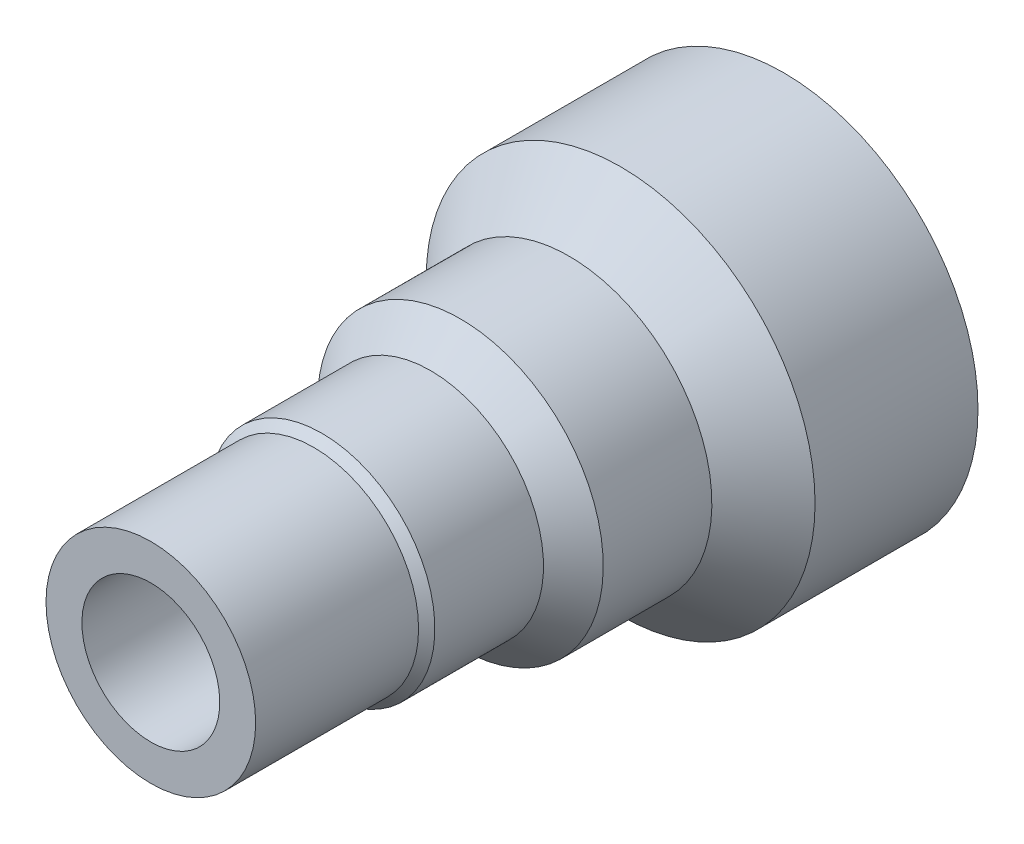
from build123d import *


with BuildPart() as part:
    # Sketch2 → Revolve1 (revolve)
    with BuildSketch(Plane(origin=(0, 0, 0), x_dir=(0, 0, -1), z_dir=(1, 0, 0)), mode=Mode.PRIVATE) as revolve1_sk:
        Polygon((22.23758084, 3), (22.23758084, 17.9), (7.23758084, 17.9), (2.48758084, 13.15), (-7.51241916, 13.15), (-10.26241916, 10.4), (-20.26241916, 10.4), (-21.01241916, 9.65), (-36.01241916, 9.65), (-36.01241916, 6.34644138), (-26.01241916, 6.34644138), (12.23758084, 3), align=None)
    revolve(revolve1_sk.sketch.rotate(Axis((0, 0, 39.29515912), (0, 0, -1)), 180), axis=Axis((0, 0, 39.29515912), (0, 0, -1)))


solid = part.part
